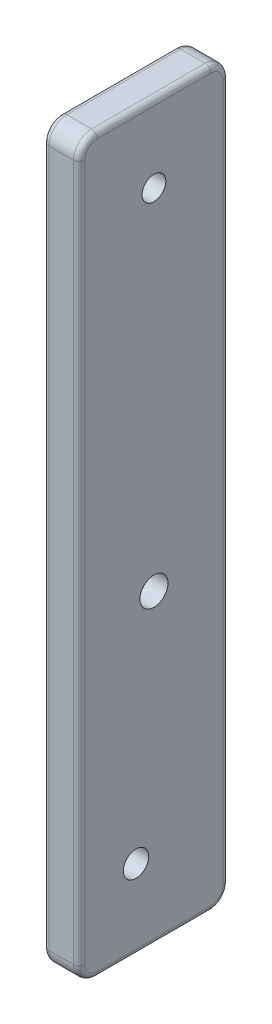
ISO-10303-21;
HEADER;
FILE_DESCRIPTION(('STEP AP214'),'2;1');
FILE_NAME('part.step','',(''),(''),'','','');
FILE_SCHEMA(('AUTOMOTIVE_DESIGN { 1 0 10303 214 1 1 1 1 }'));
ENDSEC;
DATA;
#1=APPLICATION_CONTEXT('core data for automotive mechanical design processes');
#2=APPLICATION_PROTOCOL_DEFINITION('international standard','automotive_design',2000,#1);
#3=PRODUCT_CONTEXT('',#1,'mechanical');
#4=PRODUCT('Part','Part','',(#3));
#5=PRODUCT_RELATED_PRODUCT_CATEGORY('part','',(#4));
#6=PRODUCT_DEFINITION_FORMATION('','',#4);
#7=PRODUCT_DEFINITION_CONTEXT('part definition',#1,'design');
#8=PRODUCT_DEFINITION('design','',#6,#7);
#9=PRODUCT_DEFINITION_SHAPE('','',#8);
#10=(LENGTH_UNIT() NAMED_UNIT(*) SI_UNIT(.MILLI.,.METRE.));
#11=(NAMED_UNIT(*) PLANE_ANGLE_UNIT() SI_UNIT($,.RADIAN.));
#12=(NAMED_UNIT(*) SI_UNIT($,.STERADIAN.) SOLID_ANGLE_UNIT());
#13=UNCERTAINTY_MEASURE_WITH_UNIT(LENGTH_MEASURE(1.E-05),#10,'distance_accuracy_value','');
#14=(GEOMETRIC_REPRESENTATION_CONTEXT(3) GLOBAL_UNCERTAINTY_ASSIGNED_CONTEXT((#13)) GLOBAL_UNIT_ASSIGNED_CONTEXT((#10,
#11,#12)) REPRESENTATION_CONTEXT('',''));
#15=CARTESIAN_POINT('',(0.,0.,0.));
#16=DIRECTION('',(0.,0.,1.));
#17=DIRECTION('',(1.,0.,0.));
#18=AXIS2_PLACEMENT_3D('',#15,#16,#17);
#19=CARTESIAN_POINT('',(0.,-82.45,0.));
#20=DIRECTION('',(1.,0.,0.));
#21=DIRECTION('',(0.,0.,-1.));
#22=AXIS2_PLACEMENT_3D('',#19,#20,#21);
#23=CYLINDRICAL_SURFACE('',#22,2.250000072);
#24=CARTESIAN_POINT('',(6.35,-82.45,0.));
#25=DIRECTION('',(1.,0.,0.));
#26=DIRECTION('',(0.,0.,-1.));
#27=AXIS2_PLACEMENT_3D('',#24,#25,#26);
#28=CIRCLE('',#27,2.250000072);
#29=CARTESIAN_POINT('',(6.35,-82.45,-2.25000007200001));
#30=VERTEX_POINT('',#29);
#31=EDGE_CURVE('E306',#30,#30,#28,.T.);
#32=ORIENTED_EDGE('',*,*,#31,.T.);
#33=EDGE_LOOP('',(#32));
#34=FACE_BOUND('',#33,.T.);
#35=CARTESIAN_POINT('',(1.5875,-82.45,0.));
#36=DIRECTION('',(-1.,0.,0.));
#37=DIRECTION('',(0.,0.,1.));
#38=AXIS2_PLACEMENT_3D('',#35,#36,#37);
#39=CIRCLE('',#38,2.250000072);
#40=CARTESIAN_POINT('',(1.5875,-82.45,2.25000007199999));
#41=VERTEX_POINT('',#40);
#42=EDGE_CURVE('E51',#41,#41,#39,.F.);
#43=ORIENTED_EDGE('',*,*,#42,.F.);
#44=EDGE_LOOP('',(#43));
#45=FACE_BOUND('',#44,.T.);
#46=ADVANCED_FACE('F47',(#34,#45),#23,.F.);
#47=CARTESIAN_POINT('',(6.35,-96.55,0.));
#48=DIRECTION('',(0.,-1.,0.));
#49=DIRECTION('',(0.,0.,-1.));
#50=AXIS2_PLACEMENT_3D('',#47,#48,#49);
#51=PLANE('',#50);
#52=DIRECTION('',(-1.,0.,0.));
#53=VECTOR('',#52,1.);
#54=CARTESIAN_POINT('',(6.35,-96.55,-13.225));
#55=LINE('',#54,#53);
#56=CARTESIAN_POINT('',(1.,-96.55,-13.225));
#57=VERTEX_POINT('',#56);
#58=CARTESIAN_POINT('',(5.35,-96.55,-13.225));
#59=VERTEX_POINT('',#58);
#60=EDGE_CURVE('E360',#57,#59,#55,.F.);
#61=ORIENTED_EDGE('',*,*,#60,.T.);
#62=DIRECTION('',(0.,0.,1.));
#63=VECTOR('',#62,1.);
#64=CARTESIAN_POINT('',(5.35,-96.55,0.));
#65=LINE('',#64,#63);
#66=CARTESIAN_POINT('',(5.35,-96.55,6.87499999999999));
#67=VERTEX_POINT('',#66);
#68=EDGE_CURVE('E231',#59,#67,#65,.T.);
#69=ORIENTED_EDGE('',*,*,#68,.T.);
#70=DIRECTION('',(-1.,0.,0.));
#71=VECTOR('',#70,1.);
#72=CARTESIAN_POINT('',(6.35,-96.55,6.87499999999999));
#73=LINE('',#72,#71);
#74=CARTESIAN_POINT('',(1.,-96.55,6.87499999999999));
#75=VERTEX_POINT('',#74);
#76=EDGE_CURVE('E351',#67,#75,#73,.T.);
#77=ORIENTED_EDGE('',*,*,#76,.T.);
#78=DIRECTION('',(0.,0.,1.));
#79=VECTOR('',#78,1.);
#80=CARTESIAN_POINT('',(1.,-96.55,-13.225));
#81=LINE('',#80,#79);
#82=EDGE_CURVE('E228',#75,#57,#81,.F.);
#83=ORIENTED_EDGE('',*,*,#82,.T.);
#84=EDGE_LOOP('',(#61,#69,#77,#83));
#85=FACE_BOUND('',#84,.T.);
#86=ADVANCED_FACE('F356',(#85),#51,.T.);
#87=CARTESIAN_POINT('',(6.35,0.,-16.4));
#88=DIRECTION('',(0.,0.,-1.));
#89=DIRECTION('',(0.,1.,0.));
#90=AXIS2_PLACEMENT_3D('',#87,#88,#89);
#91=PLANE('',#90);
#92=DIRECTION('',(-1.,0.,0.));
#93=VECTOR('',#92,1.);
#94=CARTESIAN_POINT('',(6.35,29.875,-16.4));
#95=LINE('',#94,#93);
#96=CARTESIAN_POINT('',(1.,29.875,-16.4));
#97=VERTEX_POINT('',#96);
#98=CARTESIAN_POINT('',(5.35,29.875,-16.4));
#99=VERTEX_POINT('',#98);
#100=EDGE_CURVE('E361',#97,#99,#95,.F.);
#101=ORIENTED_EDGE('',*,*,#100,.T.);
#102=DIRECTION('',(0.,-1.,0.));
#103=VECTOR('',#102,1.);
#104=CARTESIAN_POINT('',(5.35,0.,-16.4));
#105=LINE('',#104,#103);
#106=CARTESIAN_POINT('',(5.35,-93.375,-16.4));
#107=VERTEX_POINT('',#106);
#108=EDGE_CURVE('E237',#99,#107,#105,.T.);
#109=ORIENTED_EDGE('',*,*,#108,.T.);
#110=DIRECTION('',(-1.,0.,0.));
#111=VECTOR('',#110,1.);
#112=CARTESIAN_POINT('',(6.35,-93.375,-16.4));
#113=LINE('',#112,#111);
#114=CARTESIAN_POINT('',(1.,-93.375,-16.4));
#115=VERTEX_POINT('',#114);
#116=EDGE_CURVE('E367',#107,#115,#113,.T.);
#117=ORIENTED_EDGE('',*,*,#116,.T.);
#118=DIRECTION('',(0.,-1.,0.));
#119=VECTOR('',#118,1.);
#120=CARTESIAN_POINT('',(1.,29.875,-16.4));
#121=LINE('',#120,#119);
#122=EDGE_CURVE('E234',#115,#97,#121,.F.);
#123=ORIENTED_EDGE('',*,*,#122,.T.);
#124=EDGE_LOOP('',(#101,#109,#117,#123));
#125=FACE_BOUND('',#124,.T.);
#126=ADVANCED_FACE('F406',(#125),#91,.T.);
#127=CARTESIAN_POINT('',(6.35,33.05,0.));
#128=DIRECTION('',(0.,1.,0.));
#129=DIRECTION('',(0.,0.,1.));
#130=AXIS2_PLACEMENT_3D('',#127,#128,#129);
#131=PLANE('',#130);
#132=DIRECTION('',(-1.,0.,0.));
#133=VECTOR('',#132,1.);
#134=CARTESIAN_POINT('',(6.35,33.05,6.875));
#135=LINE('',#134,#133);
#136=CARTESIAN_POINT('',(1.,33.05,6.875));
#137=VERTEX_POINT('',#136);
#138=CARTESIAN_POINT('',(5.35,33.05,6.875));
#139=VERTEX_POINT('',#138);
#140=EDGE_CURVE('E379',#137,#139,#135,.F.);
#141=ORIENTED_EDGE('',*,*,#140,.T.);
#142=DIRECTION('',(0.,0.,-1.));
#143=VECTOR('',#142,1.);
#144=CARTESIAN_POINT('',(5.35,33.05,0.));
#145=LINE('',#144,#143);
#146=CARTESIAN_POINT('',(5.35,33.05,-13.225));
#147=VERTEX_POINT('',#146);
#148=EDGE_CURVE('E250',#139,#147,#145,.T.);
#149=ORIENTED_EDGE('',*,*,#148,.T.);
#150=DIRECTION('',(-1.,0.,0.));
#151=VECTOR('',#150,1.);
#152=CARTESIAN_POINT('',(6.35,33.05,-13.225));
#153=LINE('',#152,#151);
#154=CARTESIAN_POINT('',(1.,33.05,-13.225));
#155=VERTEX_POINT('',#154);
#156=EDGE_CURVE('E414',#147,#155,#153,.T.);
#157=ORIENTED_EDGE('',*,*,#156,.T.);
#158=DIRECTION('',(0.,0.,-1.));
#159=VECTOR('',#158,1.);
#160=CARTESIAN_POINT('',(1.,33.05,6.875));
#161=LINE('',#160,#159);
#162=EDGE_CURVE('E247',#155,#137,#161,.F.);
#163=ORIENTED_EDGE('',*,*,#162,.T.);
#164=EDGE_LOOP('',(#141,#149,#157,#163));
#165=FACE_BOUND('',#164,.T.);
#166=ADVANCED_FACE('F424',(#165),#131,.T.);
#167=CARTESIAN_POINT('',(6.35,0.,10.05));
#168=DIRECTION('',(0.,0.,1.));
#169=DIRECTION('',(0.,-1.,0.));
#170=AXIS2_PLACEMENT_3D('',#167,#168,#169);
#171=PLANE('',#170);
#172=DIRECTION('',(-1.,0.,0.));
#173=VECTOR('',#172,1.);
#174=CARTESIAN_POINT('',(6.35,-93.375,10.05));
#175=LINE('',#174,#173);
#176=CARTESIAN_POINT('',(1.,-93.375,10.05));
#177=VERTEX_POINT('',#176);
#178=CARTESIAN_POINT('',(5.35,-93.375,10.05));
#179=VERTEX_POINT('',#178);
#180=EDGE_CURVE('E194',#177,#179,#175,.F.);
#181=ORIENTED_EDGE('',*,*,#180,.T.);
#182=DIRECTION('',(0.,1.,0.));
#183=VECTOR('',#182,1.);
#184=CARTESIAN_POINT('',(5.35,0.,10.05));
#185=LINE('',#184,#183);
#186=CARTESIAN_POINT('',(5.35,29.875,10.05));
#187=VERTEX_POINT('',#186);
#188=EDGE_CURVE('E261',#179,#187,#185,.T.);
#189=ORIENTED_EDGE('',*,*,#188,.T.);
#190=DIRECTION('',(-1.,0.,0.));
#191=VECTOR('',#190,1.);
#192=CARTESIAN_POINT('',(6.35,29.875,10.05));
#193=LINE('',#192,#191);
#194=CARTESIAN_POINT('',(1.,29.875,10.05));
#195=VERTEX_POINT('',#194);
#196=EDGE_CURVE('E190',#187,#195,#193,.T.);
#197=ORIENTED_EDGE('',*,*,#196,.T.);
#198=DIRECTION('',(0.,1.,0.));
#199=VECTOR('',#198,1.);
#200=CARTESIAN_POINT('',(1.,-93.375,10.05));
#201=LINE('',#200,#199);
#202=EDGE_CURVE('E258',#195,#177,#201,.F.);
#203=ORIENTED_EDGE('',*,*,#202,.T.);
#204=EDGE_LOOP('',(#181,#189,#197,#203));
#205=FACE_BOUND('',#204,.T.);
#206=ADVANCED_FACE('F372',(#205),#171,.T.);
#207=CARTESIAN_POINT('',(6.35,0.,0.));
#208=DIRECTION('',(1.,0.,0.));
#209=DIRECTION('',(0.,0.,-1.));
#210=AXIS2_PLACEMENT_3D('',#207,#208,#209);
#211=PLANE('',#210);
#212=CARTESIAN_POINT('',(6.35,19.48,-3.17500000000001));
#213=DIRECTION('',(1.,0.,0.));
#214=DIRECTION('',(0.,0.,-1.));
#215=AXIS2_PLACEMENT_3D('',#212,#213,#214);
#216=CIRCLE('',#215,2.1);
#217=CARTESIAN_POINT('',(6.35,19.48,-5.27500000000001));
#218=VERTEX_POINT('',#217);
#219=EDGE_CURVE('E442',#218,#218,#216,.T.);
#220=ORIENTED_EDGE('',*,*,#219,.F.);
#221=EDGE_LOOP('',(#220));
#222=FACE_BOUND('',#221,.T.);
#223=CARTESIAN_POINT('',(6.35,-93.375,6.87499999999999));
#224=DIRECTION('',(1.,0.,0.));
#225=DIRECTION('',(0.,0.,-1.));
#226=AXIS2_PLACEMENT_3D('',#223,#224,#225);
#227=CIRCLE('',#226,2.175);
#228=CARTESIAN_POINT('',(6.35,-93.375,9.05000000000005));
#229=VERTEX_POINT('',#228);
#230=CARTESIAN_POINT('',(6.35,-95.55,6.87499999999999));
#231=VERTEX_POINT('',#230);
#232=EDGE_CURVE('E209',#229,#231,#227,.T.);
#233=ORIENTED_EDGE('',*,*,#232,.T.);
#234=DIRECTION('',(0.,0.,1.));
#235=VECTOR('',#234,1.);
#236=CARTESIAN_POINT('',(6.35,-95.55,0.));
#237=LINE('',#236,#235);
#238=CARTESIAN_POINT('',(6.35,-95.55,-13.225));
#239=VERTEX_POINT('',#238);
#240=EDGE_CURVE('E212',#231,#239,#237,.F.);
#241=ORIENTED_EDGE('',*,*,#240,.T.);
#242=CARTESIAN_POINT('',(6.35,-93.375,-13.225));
#243=DIRECTION('',(1.,0.,0.));
#244=DIRECTION('',(0.,0.,-1.));
#245=AXIS2_PLACEMENT_3D('',#242,#243,#244);
#246=CIRCLE('',#245,2.175);
#247=CARTESIAN_POINT('',(6.35,-93.375,-15.4));
#248=VERTEX_POINT('',#247);
#249=EDGE_CURVE('E206',#239,#248,#246,.T.);
#250=ORIENTED_EDGE('',*,*,#249,.T.);
#251=DIRECTION('',(0.,-1.,0.));
#252=VECTOR('',#251,1.);
#253=CARTESIAN_POINT('',(6.35,0.,-15.4));
#254=LINE('',#253,#252);
#255=CARTESIAN_POINT('',(6.35,29.875,-15.4));
#256=VERTEX_POINT('',#255);
#257=EDGE_CURVE('E203',#248,#256,#254,.F.);
#258=ORIENTED_EDGE('',*,*,#257,.T.);
#259=CARTESIAN_POINT('',(6.35,29.875,-13.225));
#260=DIRECTION('',(1.,0.,0.));
#261=DIRECTION('',(0.,0.,-1.));
#262=AXIS2_PLACEMENT_3D('',#259,#260,#261);
#263=CIRCLE('',#262,2.175);
#264=CARTESIAN_POINT('',(6.35,32.05,-13.225));
#265=VERTEX_POINT('',#264);
#266=EDGE_CURVE('E200',#256,#265,#263,.T.);
#267=ORIENTED_EDGE('',*,*,#266,.T.);
#268=DIRECTION('',(0.,0.,-1.));
#269=VECTOR('',#268,1.);
#270=CARTESIAN_POINT('',(6.35,32.05,0.));
#271=LINE('',#270,#269);
#272=CARTESIAN_POINT('',(6.35,32.05,6.875));
#273=VERTEX_POINT('',#272);
#274=EDGE_CURVE('E169',#265,#273,#271,.F.);
#275=ORIENTED_EDGE('',*,*,#274,.T.);
#276=CARTESIAN_POINT('',(6.35,29.875,6.875));
#277=DIRECTION('',(1.,0.,0.));
#278=DIRECTION('',(0.,0.,-1.));
#279=AXIS2_PLACEMENT_3D('',#276,#277,#278);
#280=CIRCLE('',#279,2.175);
#281=CARTESIAN_POINT('',(6.35,29.875,9.05));
#282=VERTEX_POINT('',#281);
#283=EDGE_CURVE('E160',#273,#282,#280,.T.);
#284=ORIENTED_EDGE('',*,*,#283,.T.);
#285=DIRECTION('',(0.,1.,0.));
#286=VECTOR('',#285,1.);
#287=CARTESIAN_POINT('',(6.35,0.,9.05000000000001));
#288=LINE('',#287,#286);
#289=EDGE_CURVE('E166',#282,#229,#288,.F.);
#290=ORIENTED_EDGE('',*,*,#289,.T.);
#291=EDGE_LOOP('',(#233,#241,#250,#258,#267,#275,#284,#290));
#292=FACE_BOUND('',#291,.T.);
#293=CARTESIAN_POINT('',(6.35,-42.2876338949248,-3.17500000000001));
#294=DIRECTION('',(1.,0.,0.));
#295=DIRECTION('',(0.,0.,-1.));
#296=AXIS2_PLACEMENT_3D('',#293,#294,#295);
#297=CIRCLE('',#296,2.48125);
#298=CARTESIAN_POINT('',(6.35,-42.2876338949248,-5.65625000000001));
#299=VERTEX_POINT('',#298);
#300=EDGE_CURVE('E432',#299,#299,#297,.T.);
#301=ORIENTED_EDGE('',*,*,#300,.F.);
#302=EDGE_LOOP('',(#301));
#303=FACE_BOUND('',#302,.T.);
#304=ORIENTED_EDGE('',*,*,#31,.F.);
#305=EDGE_LOOP('',(#304));
#306=FACE_BOUND('',#305,.T.);
#307=ADVANCED_FACE('F163',(#222,#292,#303,#306),#211,.T.);
#308=CARTESIAN_POINT('',(0.,0.,0.));
#309=DIRECTION('',(1.,0.,0.));
#310=DIRECTION('',(0.,0.,-1.));
#311=AXIS2_PLACEMENT_3D('',#308,#309,#310);
#312=PLANE('',#311);
#313=CARTESIAN_POINT('',(0.,-82.45,0.));
#314=DIRECTION('',(-1.,0.,0.));
#315=DIRECTION('',(0.,0.,1.));
#316=AXIS2_PLACEMENT_3D('',#313,#314,#315);
#317=CIRCLE('',#316,4.6);
#318=CARTESIAN_POINT('',(0.,-82.45,4.59999999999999));
#319=VERTEX_POINT('',#318);
#320=EDGE_CURVE('E449',#319,#319,#317,.T.);
#321=ORIENTED_EDGE('',*,*,#320,.F.);
#322=EDGE_LOOP('',(#321));
#323=FACE_BOUND('',#322,.T.);
#324=CARTESIAN_POINT('',(0.,19.48,-3.17500000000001));
#325=DIRECTION('',(1.,0.,0.));
#326=DIRECTION('',(0.,0.,-1.));
#327=AXIS2_PLACEMENT_3D('',#324,#325,#326);
#328=CIRCLE('',#327,2.1);
#329=CARTESIAN_POINT('',(0.,19.48,-5.27500000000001));
#330=VERTEX_POINT('',#329);
#331=EDGE_CURVE('E311',#330,#330,#328,.T.);
#332=ORIENTED_EDGE('',*,*,#331,.T.);
#333=EDGE_LOOP('',(#332));
#334=FACE_BOUND('',#333,.T.);
#335=DIRECTION('',(0.,0.,-1.));
#336=VECTOR('',#335,1.);
#337=CARTESIAN_POINT('',(0.,32.05,-13.225));
#338=LINE('',#337,#336);
#339=CARTESIAN_POINT('',(0.,32.05,6.875));
#340=VERTEX_POINT('',#339);
#341=CARTESIAN_POINT('',(0.,32.05,-13.225));
#342=VERTEX_POINT('',#341);
#343=EDGE_CURVE('E57',#340,#342,#338,.T.);
#344=ORIENTED_EDGE('',*,*,#343,.T.);
#345=CARTESIAN_POINT('',(0.,29.875,-13.225));
#346=DIRECTION('',(1.,0.,0.));
#347=DIRECTION('',(0.,0.,-1.));
#348=AXIS2_PLACEMENT_3D('',#345,#346,#347);
#349=CIRCLE('',#348,2.175);
#350=CARTESIAN_POINT('',(0.,29.875,-15.4));
#351=VERTEX_POINT('',#350);
#352=EDGE_CURVE('E11',#342,#351,#349,.F.);
#353=ORIENTED_EDGE('',*,*,#352,.T.);
#354=DIRECTION('',(0.,-1.,0.));
#355=VECTOR('',#354,1.);
#356=CARTESIAN_POINT('',(0.,-93.375,-15.4));
#357=LINE('',#356,#355);
#358=CARTESIAN_POINT('',(0.,-93.375,-15.4));
#359=VERTEX_POINT('',#358);
#360=EDGE_CURVE('E276',#351,#359,#357,.T.);
#361=ORIENTED_EDGE('',*,*,#360,.T.);
#362=CARTESIAN_POINT('',(0.,-93.375,-13.225));
#363=DIRECTION('',(1.,0.,0.));
#364=DIRECTION('',(0.,0.,-1.));
#365=AXIS2_PLACEMENT_3D('',#362,#363,#364);
#366=CIRCLE('',#365,2.175);
#367=CARTESIAN_POINT('',(0.,-95.55,-13.225));
#368=VERTEX_POINT('',#367);
#369=EDGE_CURVE('E273',#359,#368,#366,.F.);
#370=ORIENTED_EDGE('',*,*,#369,.T.);
#371=DIRECTION('',(0.,0.,1.));
#372=VECTOR('',#371,1.);
#373=CARTESIAN_POINT('',(0.,-95.55,6.87499999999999));
#374=LINE('',#373,#372);
#375=CARTESIAN_POINT('',(0.,-95.55,6.87499999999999));
#376=VERTEX_POINT('',#375);
#377=EDGE_CURVE('E264',#368,#376,#374,.T.);
#378=ORIENTED_EDGE('',*,*,#377,.T.);
#379=CARTESIAN_POINT('',(0.,-93.375,6.87499999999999));
#380=DIRECTION('',(1.,0.,0.));
#381=DIRECTION('',(0.,0.,-1.));
#382=AXIS2_PLACEMENT_3D('',#379,#380,#381);
#383=CIRCLE('',#382,2.175);
#384=CARTESIAN_POINT('',(0.,-93.375,9.05));
#385=VERTEX_POINT('',#384);
#386=EDGE_CURVE('E267',#376,#385,#383,.F.);
#387=ORIENTED_EDGE('',*,*,#386,.T.);
#388=DIRECTION('',(0.,1.,0.));
#389=VECTOR('',#388,1.);
#390=CARTESIAN_POINT('',(0.,29.875,9.05));
#391=LINE('',#390,#389);
#392=CARTESIAN_POINT('',(0.,29.875,9.05));
#393=VERTEX_POINT('',#392);
#394=EDGE_CURVE('E270',#385,#393,#391,.T.);
#395=ORIENTED_EDGE('',*,*,#394,.T.);
#396=CARTESIAN_POINT('',(0.,29.875,6.875));
#397=DIRECTION('',(1.,0.,0.));
#398=DIRECTION('',(0.,0.,-1.));
#399=AXIS2_PLACEMENT_3D('',#396,#397,#398);
#400=CIRCLE('',#399,2.175);
#401=EDGE_CURVE('E68',#393,#340,#400,.F.);
#402=ORIENTED_EDGE('',*,*,#401,.T.);
#403=EDGE_LOOP('',(#344,#353,#361,#370,#378,#387,#395,#402));
#404=FACE_BOUND('',#403,.T.);
#405=CARTESIAN_POINT('',(0.,-42.2876338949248,-3.17500000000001));
#406=DIRECTION('',(1.,0.,0.));
#407=DIRECTION('',(0.,0.,-1.));
#408=AXIS2_PLACEMENT_3D('',#405,#406,#407);
#409=CIRCLE('',#408,2.48125);
#410=CARTESIAN_POINT('',(0.,-42.2876338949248,-5.65625000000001));
#411=VERTEX_POINT('',#410);
#412=EDGE_CURVE('E426',#411,#411,#409,.T.);
#413=ORIENTED_EDGE('',*,*,#412,.T.);
#414=EDGE_LOOP('',(#413));
#415=FACE_BOUND('',#414,.T.);
#416=ADVANCED_FACE('F391',(#323,#334,#404,#415),#312,.F.);
#417=CARTESIAN_POINT('',(6.35,29.875,-13.225));
#418=DIRECTION('',(-1.,0.,0.));
#419=DIRECTION('',(0.,0.,1.));
#420=AXIS2_PLACEMENT_3D('',#417,#418,#419);
#421=CYLINDRICAL_SURFACE('',#420,3.175);
#422=ORIENTED_EDGE('',*,*,#156,.F.);
#423=CARTESIAN_POINT('',(5.35,29.875,-13.225));
#424=DIRECTION('',(1.,0.,0.));
#425=DIRECTION('',(0.,0.,-1.));
#426=AXIS2_PLACEMENT_3D('',#423,#424,#425);
#427=CIRCLE('',#426,3.175);
#428=EDGE_CURVE('E244',#147,#99,#427,.F.);
#429=ORIENTED_EDGE('',*,*,#428,.T.);
#430=ORIENTED_EDGE('',*,*,#100,.F.);
#431=CARTESIAN_POINT('',(1.,29.875,-13.225));
#432=DIRECTION('',(1.,0.,0.));
#433=DIRECTION('',(0.,0.,-1.));
#434=AXIS2_PLACEMENT_3D('',#431,#432,#433);
#435=CIRCLE('',#434,3.175);
#436=EDGE_CURVE('E240',#97,#155,#435,.T.);
#437=ORIENTED_EDGE('',*,*,#436,.T.);
#438=EDGE_LOOP('',(#422,#429,#430,#437));
#439=FACE_BOUND('',#438,.T.);
#440=ADVANCED_FACE('F411',(#439),#421,.T.);
#441=CARTESIAN_POINT('',(6.35,-93.375,-13.225));
#442=DIRECTION('',(-1.,0.,0.));
#443=DIRECTION('',(0.,0.,1.));
#444=AXIS2_PLACEMENT_3D('',#441,#442,#443);
#445=CYLINDRICAL_SURFACE('',#444,3.175);
#446=ORIENTED_EDGE('',*,*,#116,.F.);
#447=CARTESIAN_POINT('',(5.35,-93.375,-13.225));
#448=DIRECTION('',(1.,0.,0.));
#449=DIRECTION('',(0.,0.,-1.));
#450=AXIS2_PLACEMENT_3D('',#447,#448,#449);
#451=CIRCLE('',#450,3.175);
#452=EDGE_CURVE('E225',#107,#59,#451,.F.);
#453=ORIENTED_EDGE('',*,*,#452,.T.);
#454=ORIENTED_EDGE('',*,*,#60,.F.);
#455=CARTESIAN_POINT('',(1.,-93.375,-13.225));
#456=DIRECTION('',(1.,0.,0.));
#457=DIRECTION('',(0.,0.,-1.));
#458=AXIS2_PLACEMENT_3D('',#455,#456,#457);
#459=CIRCLE('',#458,3.175);
#460=EDGE_CURVE('E222',#57,#115,#459,.T.);
#461=ORIENTED_EDGE('',*,*,#460,.T.);
#462=EDGE_LOOP('',(#446,#453,#454,#461));
#463=FACE_BOUND('',#462,.T.);
#464=ADVANCED_FACE('F493',(#463),#445,.T.);
#465=CARTESIAN_POINT('',(6.35,-93.375,6.87499999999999));
#466=DIRECTION('',(-1.,0.,0.));
#467=DIRECTION('',(0.,0.,1.));
#468=AXIS2_PLACEMENT_3D('',#465,#466,#467);
#469=CYLINDRICAL_SURFACE('',#468,3.175);
#470=ORIENTED_EDGE('',*,*,#76,.F.);
#471=CARTESIAN_POINT('',(5.35,-93.375,6.87499999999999));
#472=DIRECTION('',(1.,0.,0.));
#473=DIRECTION('',(0.,0.,-1.));
#474=AXIS2_PLACEMENT_3D('',#471,#472,#473);
#475=CIRCLE('',#474,3.175);
#476=EDGE_CURVE('E218',#67,#179,#475,.F.);
#477=ORIENTED_EDGE('',*,*,#476,.T.);
#478=ORIENTED_EDGE('',*,*,#180,.F.);
#479=CARTESIAN_POINT('',(1.,-93.375,6.87499999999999));
#480=DIRECTION('',(1.,0.,0.));
#481=DIRECTION('',(0.,0.,-1.));
#482=AXIS2_PLACEMENT_3D('',#479,#480,#481);
#483=CIRCLE('',#482,3.175);
#484=EDGE_CURVE('E215',#177,#75,#483,.T.);
#485=ORIENTED_EDGE('',*,*,#484,.T.);
#486=EDGE_LOOP('',(#470,#477,#478,#485));
#487=FACE_BOUND('',#486,.T.);
#488=ADVANCED_FACE('F350',(#487),#469,.T.);
#489=CARTESIAN_POINT('',(6.35,29.875,6.875));
#490=DIRECTION('',(-1.,0.,0.));
#491=DIRECTION('',(0.,0.,1.));
#492=AXIS2_PLACEMENT_3D('',#489,#490,#491);
#493=CYLINDRICAL_SURFACE('',#492,3.175);
#494=ORIENTED_EDGE('',*,*,#196,.F.);
#495=CARTESIAN_POINT('',(5.35,29.875,6.875));
#496=DIRECTION('',(1.,0.,0.));
#497=DIRECTION('',(0.,0.,-1.));
#498=AXIS2_PLACEMENT_3D('',#495,#496,#497);
#499=CIRCLE('',#498,3.175);
#500=EDGE_CURVE('E179',#187,#139,#499,.F.);
#501=ORIENTED_EDGE('',*,*,#500,.T.);
#502=ORIENTED_EDGE('',*,*,#140,.F.);
#503=CARTESIAN_POINT('',(1.,29.875,6.875));
#504=DIRECTION('',(1.,0.,0.));
#505=DIRECTION('',(0.,0.,-1.));
#506=AXIS2_PLACEMENT_3D('',#503,#504,#505);
#507=CIRCLE('',#506,3.175);
#508=EDGE_CURVE('E253',#137,#195,#507,.T.);
#509=ORIENTED_EDGE('',*,*,#508,.T.);
#510=EDGE_LOOP('',(#494,#501,#502,#509));
#511=FACE_BOUND('',#510,.T.);
#512=ADVANCED_FACE('F375',(#511),#493,.T.);
#513=CARTESIAN_POINT('',(0.,-42.2876338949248,-3.17500000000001));
#514=DIRECTION('',(1.,0.,0.));
#515=DIRECTION('',(0.,0.,-1.));
#516=AXIS2_PLACEMENT_3D('',#513,#514,#515);
#517=CYLINDRICAL_SURFACE('',#516,2.48125);
#518=ORIENTED_EDGE('',*,*,#412,.F.);
#519=EDGE_LOOP('',(#518));
#520=FACE_BOUND('',#519,.T.);
#521=ORIENTED_EDGE('',*,*,#300,.T.);
#522=EDGE_LOOP('',(#521));
#523=FACE_BOUND('',#522,.T.);
#524=ADVANCED_FACE('F475',(#520,#523),#517,.F.);
#525=CARTESIAN_POINT('',(5.35,29.875,-13.225));
#526=DIRECTION('',(1.,0.,0.));
#527=DIRECTION('',(0.,0.,-1.));
#528=AXIS2_PLACEMENT_3D('',#525,#526,#527);
#529=TOROIDAL_SURFACE('',#528,2.175,1.);
#530=CARTESIAN_POINT('',(5.35,29.875,-15.4));
#531=DIRECTION('',(0.,-1.,0.));
#532=DIRECTION('',(0.,0.,-1.));
#533=AXIS2_PLACEMENT_3D('',#530,#531,#532);
#534=CIRCLE('',#533,1.);
#535=EDGE_CURVE('E298',#99,#256,#534,.T.);
#536=ORIENTED_EDGE('',*,*,#535,.F.);
#537=ORIENTED_EDGE('',*,*,#428,.F.);
#538=CARTESIAN_POINT('',(5.35,32.05,-13.225));
#539=DIRECTION('',(0.,0.,1.));
#540=DIRECTION('',(1.,0.,0.));
#541=AXIS2_PLACEMENT_3D('',#538,#539,#540);
#542=CIRCLE('',#541,1.);
#543=EDGE_CURVE('E302',#265,#147,#542,.T.);
#544=ORIENTED_EDGE('',*,*,#543,.F.);
#545=ORIENTED_EDGE('',*,*,#266,.F.);
#546=EDGE_LOOP('',(#536,#537,#544,#545));
#547=FACE_BOUND('',#546,.T.);
#548=ADVANCED_FACE('F417',(#547),#529,.T.);
#549=CARTESIAN_POINT('',(5.35,32.05,0.));
#550=DIRECTION('',(0.,0.,-1.));
#551=DIRECTION('',(-1.,0.,0.));
#552=AXIS2_PLACEMENT_3D('',#549,#550,#551);
#553=CYLINDRICAL_SURFACE('',#552,1.);
#554=ORIENTED_EDGE('',*,*,#543,.T.);
#555=ORIENTED_EDGE('',*,*,#148,.F.);
#556=CARTESIAN_POINT('',(5.35,32.05,6.875));
#557=DIRECTION('',(0.,0.,1.));
#558=DIRECTION('',(1.,0.,0.));
#559=AXIS2_PLACEMENT_3D('',#556,#557,#558);
#560=CIRCLE('',#559,1.);
#561=EDGE_CURVE('E295',#273,#139,#560,.T.);
#562=ORIENTED_EDGE('',*,*,#561,.F.);
#563=ORIENTED_EDGE('',*,*,#274,.F.);
#564=EDGE_LOOP('',(#554,#555,#562,#563));
#565=FACE_BOUND('',#564,.T.);
#566=ADVANCED_FACE('F422',(#565),#553,.T.);
#567=CARTESIAN_POINT('',(5.35,0.,-15.4));
#568=DIRECTION('',(0.,-1.,0.));
#569=DIRECTION('',(0.,0.,-1.));
#570=AXIS2_PLACEMENT_3D('',#567,#568,#569);
#571=CYLINDRICAL_SURFACE('',#570,1.);
#572=ORIENTED_EDGE('',*,*,#535,.T.);
#573=ORIENTED_EDGE('',*,*,#257,.F.);
#574=CARTESIAN_POINT('',(5.35,-93.375,-15.4));
#575=DIRECTION('',(0.,-1.,0.));
#576=DIRECTION('',(0.,0.,-1.));
#577=AXIS2_PLACEMENT_3D('',#574,#575,#576);
#578=CIRCLE('',#577,1.);
#579=EDGE_CURVE('E183',#107,#248,#578,.T.);
#580=ORIENTED_EDGE('',*,*,#579,.F.);
#581=ORIENTED_EDGE('',*,*,#108,.F.);
#582=EDGE_LOOP('',(#572,#573,#580,#581));
#583=FACE_BOUND('',#582,.T.);
#584=ADVANCED_FACE('F517',(#583),#571,.T.);
#585=CARTESIAN_POINT('',(5.35,29.875,6.875));
#586=DIRECTION('',(1.,0.,0.));
#587=DIRECTION('',(0.,0.,-1.));
#588=AXIS2_PLACEMENT_3D('',#585,#586,#587);
#589=TOROIDAL_SURFACE('',#588,2.175,1.);
#590=ORIENTED_EDGE('',*,*,#561,.T.);
#591=ORIENTED_EDGE('',*,*,#500,.F.);
#592=CARTESIAN_POINT('',(5.35,29.875,9.05));
#593=DIRECTION('',(0.,-1.,0.));
#594=DIRECTION('',(0.,0.,-1.));
#595=AXIS2_PLACEMENT_3D('',#592,#593,#594);
#596=CIRCLE('',#595,1.);
#597=EDGE_CURVE('E177',#282,#187,#596,.T.);
#598=ORIENTED_EDGE('',*,*,#597,.F.);
#599=ORIENTED_EDGE('',*,*,#283,.F.);
#600=EDGE_LOOP('',(#590,#591,#598,#599));
#601=FACE_BOUND('',#600,.T.);
#602=ADVANCED_FACE('F178',(#601),#589,.T.);
#603=CARTESIAN_POINT('',(5.35,-93.375,-13.225));
#604=DIRECTION('',(1.,0.,0.));
#605=DIRECTION('',(0.,0.,-1.));
#606=AXIS2_PLACEMENT_3D('',#603,#604,#605);
#607=TOROIDAL_SURFACE('',#606,2.175,1.);
#608=ORIENTED_EDGE('',*,*,#579,.T.);
#609=ORIENTED_EDGE('',*,*,#249,.F.);
#610=CARTESIAN_POINT('',(5.35,-95.55,-13.225));
#611=DIRECTION('',(0.,0.,1.));
#612=DIRECTION('',(1.,0.,0.));
#613=AXIS2_PLACEMENT_3D('',#610,#611,#612);
#614=CIRCLE('',#613,1.);
#615=EDGE_CURVE('E184',#59,#239,#614,.T.);
#616=ORIENTED_EDGE('',*,*,#615,.F.);
#617=ORIENTED_EDGE('',*,*,#452,.F.);
#618=EDGE_LOOP('',(#608,#609,#616,#617));
#619=FACE_BOUND('',#618,.T.);
#620=ADVANCED_FACE('F511',(#619),#607,.T.);
#621=CARTESIAN_POINT('',(5.35,0.,9.05000000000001));
#622=DIRECTION('',(0.,1.,0.));
#623=DIRECTION('',(0.,0.,1.));
#624=AXIS2_PLACEMENT_3D('',#621,#622,#623);
#625=CYLINDRICAL_SURFACE('',#624,1.);
#626=ORIENTED_EDGE('',*,*,#597,.T.);
#627=ORIENTED_EDGE('',*,*,#188,.F.);
#628=CARTESIAN_POINT('',(5.35,-93.375,9.05000000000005));
#629=DIRECTION('',(0.,-1.,0.));
#630=DIRECTION('',(0.,0.,-1.));
#631=AXIS2_PLACEMENT_3D('',#628,#629,#630);
#632=CIRCLE('',#631,1.);
#633=EDGE_CURVE('E187',#229,#179,#632,.T.);
#634=ORIENTED_EDGE('',*,*,#633,.F.);
#635=ORIENTED_EDGE('',*,*,#289,.F.);
#636=EDGE_LOOP('',(#626,#627,#634,#635));
#637=FACE_BOUND('',#636,.T.);
#638=ADVANCED_FACE('F186',(#637),#625,.T.);
#639=CARTESIAN_POINT('',(5.35,-95.55,0.));
#640=DIRECTION('',(0.,0.,1.));
#641=DIRECTION('',(1.,0.,0.));
#642=AXIS2_PLACEMENT_3D('',#639,#640,#641);
#643=CYLINDRICAL_SURFACE('',#642,1.);
#644=ORIENTED_EDGE('',*,*,#615,.T.);
#645=ORIENTED_EDGE('',*,*,#240,.F.);
#646=CARTESIAN_POINT('',(5.35,-95.55,6.87499999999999));
#647=DIRECTION('',(0.,0.,1.));
#648=DIRECTION('',(1.,0.,0.));
#649=AXIS2_PLACEMENT_3D('',#646,#647,#648);
#650=CIRCLE('',#649,1.);
#651=EDGE_CURVE('E283',#67,#231,#650,.T.);
#652=ORIENTED_EDGE('',*,*,#651,.F.);
#653=ORIENTED_EDGE('',*,*,#68,.F.);
#654=EDGE_LOOP('',(#644,#645,#652,#653));
#655=FACE_BOUND('',#654,.T.);
#656=ADVANCED_FACE('F504',(#655),#643,.T.);
#657=CARTESIAN_POINT('',(5.35,-93.375,6.87499999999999));
#658=DIRECTION('',(1.,0.,0.));
#659=DIRECTION('',(0.,0.,-1.));
#660=AXIS2_PLACEMENT_3D('',#657,#658,#659);
#661=TOROIDAL_SURFACE('',#660,2.175,1.);
#662=ORIENTED_EDGE('',*,*,#633,.T.);
#663=ORIENTED_EDGE('',*,*,#476,.F.);
#664=ORIENTED_EDGE('',*,*,#651,.T.);
#665=ORIENTED_EDGE('',*,*,#232,.F.);
#666=EDGE_LOOP('',(#662,#663,#664,#665));
#667=FACE_BOUND('',#666,.T.);
#668=ADVANCED_FACE('F501',(#667),#661,.T.);
#669=CARTESIAN_POINT('',(1.,-93.375,6.87499999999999));
#670=DIRECTION('',(1.,0.,0.));
#671=DIRECTION('',(0.,0.,-1.));
#672=AXIS2_PLACEMENT_3D('',#669,#670,#671);
#673=TOROIDAL_SURFACE('',#672,2.175,1.);
#674=CARTESIAN_POINT('',(1.,-95.55,6.87499999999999));
#675=DIRECTION('',(0.,0.,-1.));
#676=DIRECTION('',(-1.,0.,0.));
#677=AXIS2_PLACEMENT_3D('',#674,#675,#676);
#678=CIRCLE('',#677,1.);
#679=EDGE_CURVE('E330',#75,#376,#678,.T.);
#680=ORIENTED_EDGE('',*,*,#679,.F.);
#681=ORIENTED_EDGE('',*,*,#484,.F.);
#682=CARTESIAN_POINT('',(1.,-93.375,9.05));
#683=DIRECTION('',(0.,1.,0.));
#684=DIRECTION('',(0.,0.,1.));
#685=AXIS2_PLACEMENT_3D('',#682,#683,#684);
#686=CIRCLE('',#685,1.);
#687=EDGE_CURVE('E286',#385,#177,#686,.T.);
#688=ORIENTED_EDGE('',*,*,#687,.F.);
#689=ORIENTED_EDGE('',*,*,#386,.F.);
#690=EDGE_LOOP('',(#680,#681,#688,#689));
#691=FACE_BOUND('',#690,.T.);
#692=ADVANCED_FACE('F49',(#691),#673,.T.);
#693=CARTESIAN_POINT('',(1.,0.,9.05000000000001));
#694=DIRECTION('',(0.,-1.,0.));
#695=DIRECTION('',(0.,0.,-1.));
#696=AXIS2_PLACEMENT_3D('',#693,#694,#695);
#697=CYLINDRICAL_SURFACE('',#696,1.);
#698=ORIENTED_EDGE('',*,*,#687,.T.);
#699=ORIENTED_EDGE('',*,*,#202,.F.);
#700=CARTESIAN_POINT('',(1.,29.875,9.05));
#701=DIRECTION('',(0.,1.,0.));
#702=DIRECTION('',(0.,0.,1.));
#703=AXIS2_PLACEMENT_3D('',#700,#701,#702);
#704=CIRCLE('',#703,1.);
#705=EDGE_CURVE('E326',#393,#195,#704,.T.);
#706=ORIENTED_EDGE('',*,*,#705,.F.);
#707=ORIENTED_EDGE('',*,*,#394,.F.);
#708=EDGE_LOOP('',(#698,#699,#706,#707));
#709=FACE_BOUND('',#708,.T.);
#710=ADVANCED_FACE('F339',(#709),#697,.T.);
#711=CARTESIAN_POINT('',(1.,-95.55,0.));
#712=DIRECTION('',(0.,0.,-1.));
#713=DIRECTION('',(-1.,0.,0.));
#714=AXIS2_PLACEMENT_3D('',#711,#712,#713);
#715=CYLINDRICAL_SURFACE('',#714,1.);
#716=ORIENTED_EDGE('',*,*,#679,.T.);
#717=ORIENTED_EDGE('',*,*,#377,.F.);
#718=CARTESIAN_POINT('',(1.,-95.55,-13.225));
#719=DIRECTION('',(0.,0.,-1.));
#720=DIRECTION('',(-1.,0.,0.));
#721=AXIS2_PLACEMENT_3D('',#718,#719,#720);
#722=CIRCLE('',#721,1.);
#723=EDGE_CURVE('E322',#57,#368,#722,.T.);
#724=ORIENTED_EDGE('',*,*,#723,.F.);
#725=ORIENTED_EDGE('',*,*,#82,.F.);
#726=EDGE_LOOP('',(#716,#717,#724,#725));
#727=FACE_BOUND('',#726,.T.);
#728=ADVANCED_FACE('F535',(#727),#715,.T.);
#729=CARTESIAN_POINT('',(1.,29.875,6.875));
#730=DIRECTION('',(1.,0.,0.));
#731=DIRECTION('',(0.,0.,-1.));
#732=AXIS2_PLACEMENT_3D('',#729,#730,#731);
#733=TOROIDAL_SURFACE('',#732,2.175,1.);
#734=ORIENTED_EDGE('',*,*,#705,.T.);
#735=ORIENTED_EDGE('',*,*,#508,.F.);
#736=CARTESIAN_POINT('',(1.,32.05,6.875));
#737=DIRECTION('',(0.,0.,-1.));
#738=DIRECTION('',(-1.,0.,0.));
#739=AXIS2_PLACEMENT_3D('',#736,#737,#738);
#740=CIRCLE('',#739,1.);
#741=EDGE_CURVE('E318',#340,#137,#740,.T.);
#742=ORIENTED_EDGE('',*,*,#741,.F.);
#743=ORIENTED_EDGE('',*,*,#401,.F.);
#744=EDGE_LOOP('',(#734,#735,#742,#743));
#745=FACE_BOUND('',#744,.T.);
#746=ADVANCED_FACE('F381',(#745),#733,.T.);
#747=CARTESIAN_POINT('',(1.,-93.375,-13.225));
#748=DIRECTION('',(1.,0.,0.));
#749=DIRECTION('',(0.,0.,-1.));
#750=AXIS2_PLACEMENT_3D('',#747,#748,#749);
#751=TOROIDAL_SURFACE('',#750,2.175,1.);
#752=ORIENTED_EDGE('',*,*,#723,.T.);
#753=ORIENTED_EDGE('',*,*,#369,.F.);
#754=CARTESIAN_POINT('',(1.,-93.375,-15.4));
#755=DIRECTION('',(0.,1.,0.));
#756=DIRECTION('',(0.,0.,1.));
#757=AXIS2_PLACEMENT_3D('',#754,#755,#756);
#758=CIRCLE('',#757,1.);
#759=EDGE_CURVE('E314',#115,#359,#758,.T.);
#760=ORIENTED_EDGE('',*,*,#759,.F.);
#761=ORIENTED_EDGE('',*,*,#460,.F.);
#762=EDGE_LOOP('',(#752,#753,#760,#761));
#763=FACE_BOUND('',#762,.T.);
#764=ADVANCED_FACE('F398',(#763),#751,.T.);
#765=CARTESIAN_POINT('',(1.,32.05,0.));
#766=DIRECTION('',(0.,0.,1.));
#767=DIRECTION('',(1.,0.,0.));
#768=AXIS2_PLACEMENT_3D('',#765,#766,#767);
#769=CYLINDRICAL_SURFACE('',#768,1.);
#770=ORIENTED_EDGE('',*,*,#741,.T.);
#771=ORIENTED_EDGE('',*,*,#162,.F.);
#772=CARTESIAN_POINT('',(1.,32.05,-13.225));
#773=DIRECTION('',(0.,0.,-1.));
#774=DIRECTION('',(-1.,0.,0.));
#775=AXIS2_PLACEMENT_3D('',#772,#773,#774);
#776=CIRCLE('',#775,1.);
#777=EDGE_CURVE('E310',#342,#155,#776,.T.);
#778=ORIENTED_EDGE('',*,*,#777,.F.);
#779=ORIENTED_EDGE('',*,*,#343,.F.);
#780=EDGE_LOOP('',(#770,#771,#778,#779));
#781=FACE_BOUND('',#780,.T.);
#782=ADVANCED_FACE('F384',(#781),#769,.T.);
#783=CARTESIAN_POINT('',(1.,0.,-15.4));
#784=DIRECTION('',(0.,1.,0.));
#785=DIRECTION('',(0.,0.,1.));
#786=AXIS2_PLACEMENT_3D('',#783,#784,#785);
#787=CYLINDRICAL_SURFACE('',#786,1.);
#788=ORIENTED_EDGE('',*,*,#759,.T.);
#789=ORIENTED_EDGE('',*,*,#360,.F.);
#790=CARTESIAN_POINT('',(1.,29.875,-15.4));
#791=DIRECTION('',(0.,1.,0.));
#792=DIRECTION('',(0.,0.,1.));
#793=AXIS2_PLACEMENT_3D('',#790,#791,#792);
#794=CIRCLE('',#793,1.);
#795=EDGE_CURVE('E307',#97,#351,#794,.T.);
#796=ORIENTED_EDGE('',*,*,#795,.F.);
#797=ORIENTED_EDGE('',*,*,#122,.F.);
#798=EDGE_LOOP('',(#788,#789,#796,#797));
#799=FACE_BOUND('',#798,.T.);
#800=ADVANCED_FACE('F402',(#799),#787,.T.);
#801=CARTESIAN_POINT('',(1.,29.875,-13.225));
#802=DIRECTION('',(1.,0.,0.));
#803=DIRECTION('',(0.,0.,-1.));
#804=AXIS2_PLACEMENT_3D('',#801,#802,#803);
#805=TOROIDAL_SURFACE('',#804,2.175,1.);
#806=ORIENTED_EDGE('',*,*,#777,.T.);
#807=ORIENTED_EDGE('',*,*,#436,.F.);
#808=ORIENTED_EDGE('',*,*,#795,.T.);
#809=ORIENTED_EDGE('',*,*,#352,.F.);
#810=EDGE_LOOP('',(#806,#807,#808,#809));
#811=FACE_BOUND('',#810,.T.);
#812=ADVANCED_FACE('F388',(#811),#805,.T.);
#813=CARTESIAN_POINT('',(0.,19.48,-3.17500000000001));
#814=DIRECTION('',(1.,0.,0.));
#815=DIRECTION('',(0.,0.,-1.));
#816=AXIS2_PLACEMENT_3D('',#813,#814,#815);
#817=CYLINDRICAL_SURFACE('',#816,2.1);
#818=ORIENTED_EDGE('',*,*,#331,.F.);
#819=EDGE_LOOP('',(#818));
#820=FACE_BOUND('',#819,.T.);
#821=ORIENTED_EDGE('',*,*,#219,.T.);
#822=EDGE_LOOP('',(#821));
#823=FACE_BOUND('',#822,.T.);
#824=ADVANCED_FACE('F473',(#820,#823),#817,.F.);
#825=CARTESIAN_POINT('',(1.5875,-82.45,0.));
#826=DIRECTION('',(-1.,0.,0.));
#827=DIRECTION('',(0.,0.,1.));
#828=AXIS2_PLACEMENT_3D('',#825,#826,#827);
#829=PLANE('',#828);
#830=CARTESIAN_POINT('',(1.5875,-82.45,0.));
#831=DIRECTION('',(-1.,0.,0.));
#832=DIRECTION('',(0.,0.,1.));
#833=AXIS2_PLACEMENT_3D('',#830,#831,#832);
#834=CIRCLE('',#833,4.6);
#835=CARTESIAN_POINT('',(1.5875,-82.45,4.59999999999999));
#836=VERTEX_POINT('',#835);
#837=EDGE_CURVE('E453',#836,#836,#834,.T.);
#838=ORIENTED_EDGE('',*,*,#837,.T.);
#839=EDGE_LOOP('',(#838));
#840=FACE_BOUND('',#839,.T.);
#841=ORIENTED_EDGE('',*,*,#42,.T.);
#842=EDGE_LOOP('',(#841));
#843=FACE_BOUND('',#842,.T.);
#844=ADVANCED_FACE('F462',(#840,#843),#829,.T.);
#845=CARTESIAN_POINT('',(1.5875,-82.45,0.));
#846=DIRECTION('',(-1.,0.,0.));
#847=DIRECTION('',(0.,0.,1.));
#848=AXIS2_PLACEMENT_3D('',#845,#846,#847);
#849=CYLINDRICAL_SURFACE('',#848,4.6);
#850=ORIENTED_EDGE('',*,*,#837,.F.);
#851=EDGE_LOOP('',(#850));
#852=FACE_BOUND('',#851,.T.);
#853=ORIENTED_EDGE('',*,*,#320,.T.);
#854=EDGE_LOOP('',(#853));
#855=FACE_BOUND('',#854,.T.);
#856=ADVANCED_FACE('F799',(#852,#855),#849,.F.);
#857=CLOSED_SHELL('',(#46,#86,#126,#166,#206,#307,#416,#440,#464,#488,#512,#524,#548,#566,#584,
#602,#620,#638,#656,#668,#692,#710,#728,#746,#764,#782,#800,#812,#824,#844,#856));
#858=MANIFOLD_SOLID_BREP('B2',#857);
#859=ADVANCED_BREP_SHAPE_REPRESENTATION('',(#18,#858),#14);
#860=SHAPE_DEFINITION_REPRESENTATION(#9,#859);
ENDSEC;
END-ISO-10303-21;
